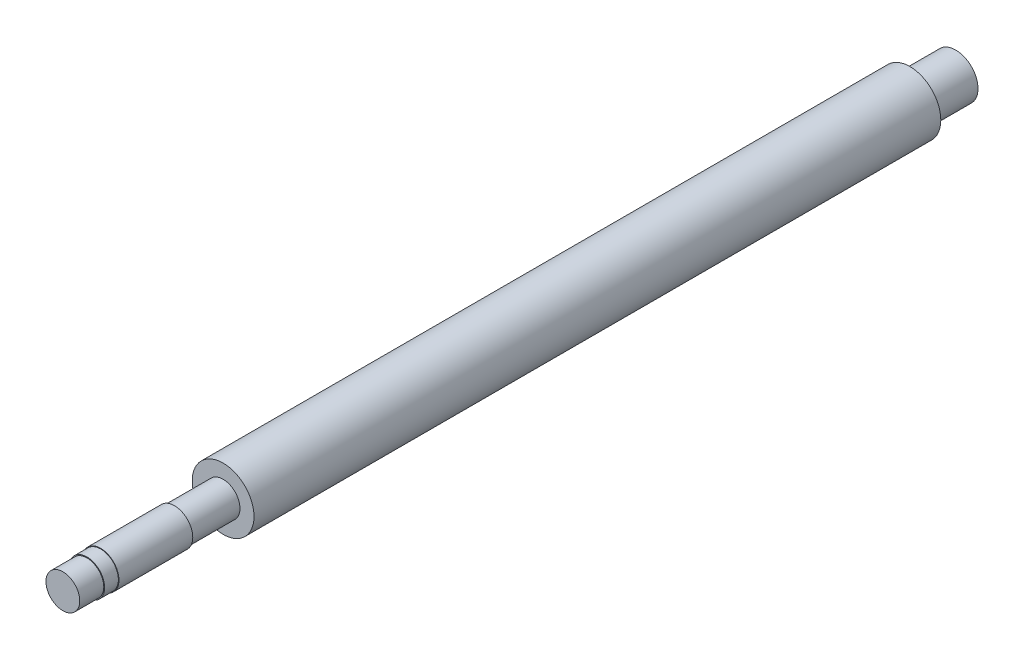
from build123d import *

# Parameters (mm, degrees)
ESBO_O1_R                = 2.7
RESSALTO_EXTRUS_O1_DEPTH = 60
ESBO_O2_R                = 1.475
RESSALTO_EXTRUS_O2_DEPTH = 14
ESBO_O3_R                = 1.95
RESSALTO_EXTRUS_O3_DEPTH = 4
ESBO_O6_R                = 1.6
RESSALTO_EXTRUS_O4_DEPTH = 6.45
RESSALTO_EXTRUS_O5_REACH = 77.996
ESBO_O7_R                = 1.55


with BuildPart() as part:
    # Esbo_o1 → Ressalto-extrus_o1 (new body)
    with BuildSketch(Plane.XY):
        Circle(ESBO_O1_R)
    extrude(amount=RESSALTO_EXTRUS_O1_DEPTH)

    # Esbo_o2 → Ressalto-extrus_o2 (add)
    with BuildSketch(Plane.XY.offset(60)):
        Circle(ESBO_O2_R)
    extrude(amount=RESSALTO_EXTRUS_O2_DEPTH)

    # Esbo_o3 → Ressalto-extrus_o3 (add)
    with BuildSketch(Plane(origin=(0, 0, 0), x_dir=(-1, 0, 0), z_dir=(0, 0, -1))):
        with Locations(Location((0, 0, 0), (0, 0, 180))):
            Circle(ESBO_O3_R)
    extrude(amount=RESSALTO_EXTRUS_O3_DEPTH)

    # Esbo_o6 → Ressalto-extrus_o4 (add)
    with BuildSketch(Plane.XY.offset(70.7)):
        Circle(ESBO_O6_R)
    extrude(amount=-RESSALTO_EXTRUS_O4_DEPTH)

    # Esbo_o7 → Ressalto-extrus_o5 (add, up to next)
    with BuildSketch(Plane.XY.offset(71.9), mode=Mode.PRIVATE) as ressalto_extrus_o5_sk1:
        Circle(ESBO_O7_R)
    ressalto_extrus_o5_tool1 = extrude(ressalto_extrus_o5_sk1.sketch, amount=-RESSALTO_EXTRUS_O5_REACH, mode=Mode.PRIVATE) - part.part
    add(ressalto_extrus_o5_tool1.solids().sort_by_distance((0, 0, 71.9))[0])


solid = part.part
